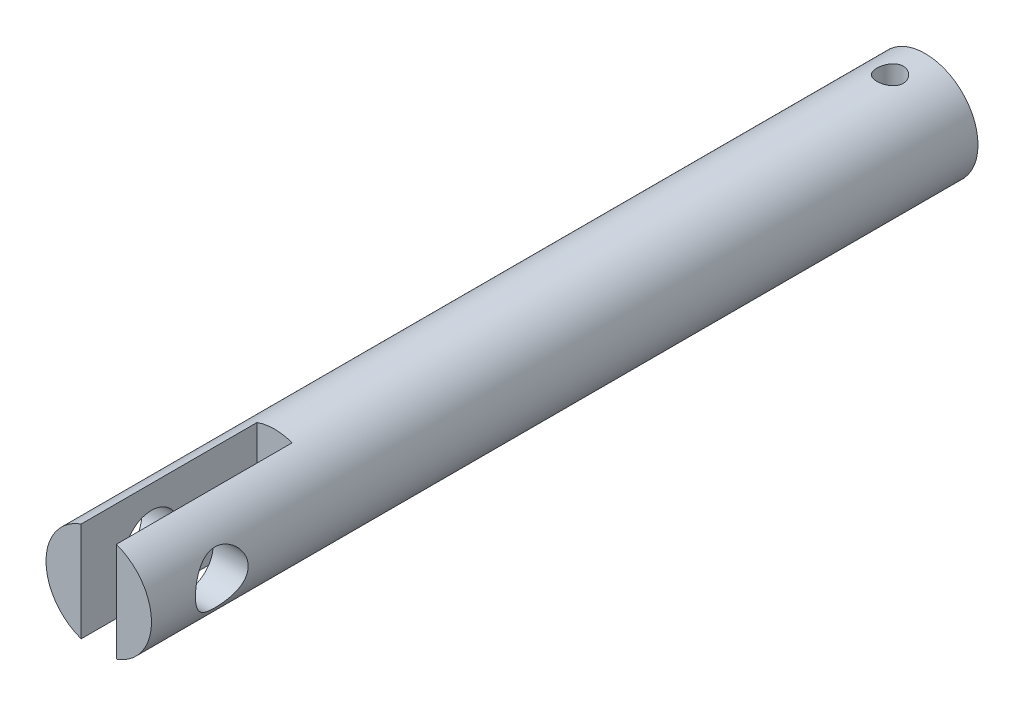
from build123d import *

# Parameters (mm, degrees)
SKETCH1_R               = 4.7625
EXTRUDE1_DEPTH          = 74.6125
CUT_EXTRUDE1_DEPTH      = 75.915872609
CUT_EXTRUDE1_DEPTH_BACK = 75.915872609
SKETCH2_R               = 1.190625
SKETCH2_W               = 3.175
SKETCH2_H               = 15.875
CUT_EXTRUDE2_DEPTH      = 75.915872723
CUT_EXTRUDE2_DEPTH_BACK = 75.915872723
SKETCH3_R               = 2.38125


with BuildPart() as part:
    # Sketch1 → Extrude1 (new body)
    with BuildSketch(Plane.XY):
        Circle(SKETCH1_R)
    extrude(amount=EXTRUDE1_DEPTH)

    # Sketch2 → Cut-Extrude1 (cut, two sides: drawn at the far end of the back side and taken through both)
    with BuildSketch(Plane(origin=(0, 0, 0), x_dir=(1, 0, 0), z_dir=(0, 1, 0)).offset(-CUT_EXTRUDE1_DEPTH_BACK)):
        with Locations(Location((0, -3.175, 0), (0, 0, 270))):
            Circle(SKETCH2_R)
        with Locations((0, -66.675)):
            Rectangle(SKETCH2_W, SKETCH2_H)
    extrude(amount=CUT_EXTRUDE1_DEPTH + CUT_EXTRUDE1_DEPTH_BACK, mode=Mode.SUBTRACT)

    # Sketch3 → Cut-Extrude2 (cut, two sides: drawn at the far end of the back side and taken through both)
    with BuildSketch(Plane(origin=(0, 0, 0), x_dir=(0, 0, -1), z_dir=(1, 0, 0)).offset(-CUT_EXTRUDE2_DEPTH_BACK)):
        with Locations((-68.2625, 0)):
            Circle(SKETCH3_R)
    extrude(amount=CUT_EXTRUDE2_DEPTH + CUT_EXTRUDE2_DEPTH_BACK, mode=Mode.SUBTRACT)


solid = part.part
